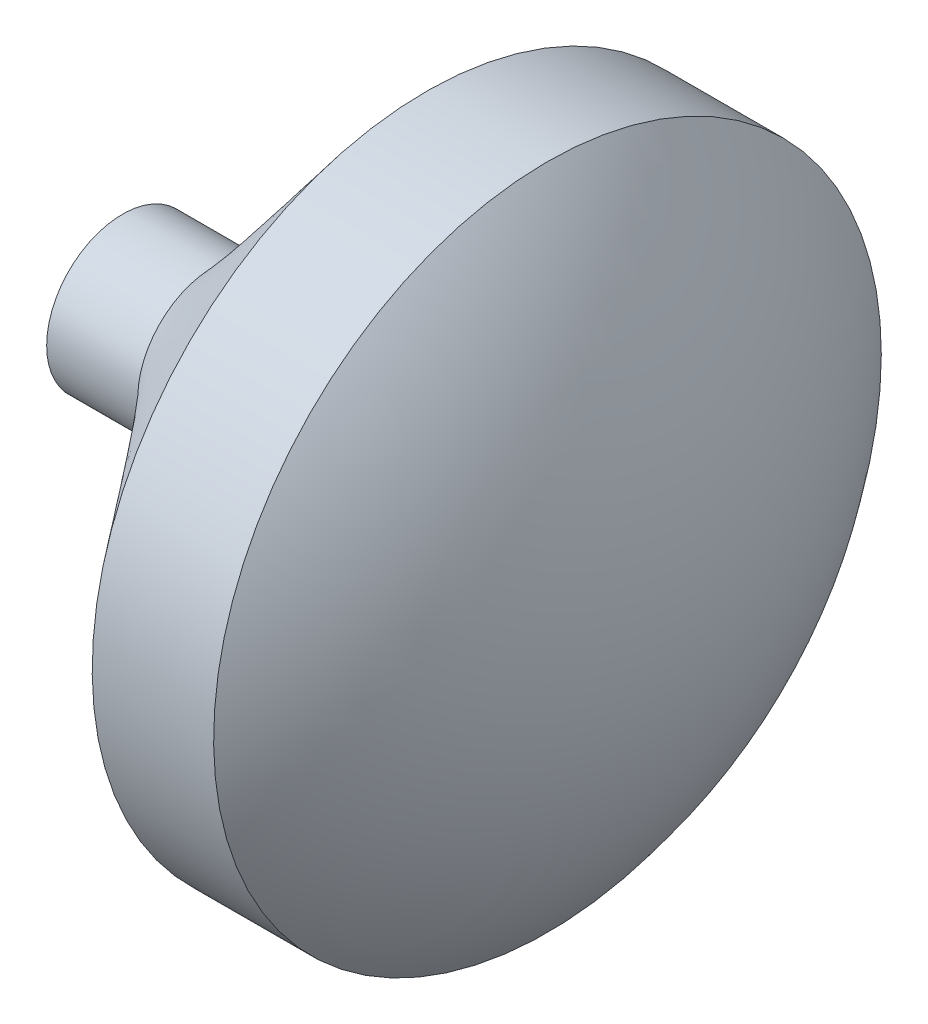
ISO-10303-21;
HEADER;
FILE_DESCRIPTION(('STEP AP214'),'2;1');
FILE_NAME('part.step','',(''),(''),'','','');
FILE_SCHEMA(('AUTOMOTIVE_DESIGN { 1 0 10303 214 1 1 1 1 }'));
ENDSEC;
DATA;
#1=APPLICATION_CONTEXT('core data for automotive mechanical design processes');
#2=APPLICATION_PROTOCOL_DEFINITION('international standard','automotive_design',2000,#1);
#3=PRODUCT_CONTEXT('',#1,'mechanical');
#4=PRODUCT('Part','Part','',(#3));
#5=PRODUCT_RELATED_PRODUCT_CATEGORY('part','',(#4));
#6=PRODUCT_DEFINITION_FORMATION('','',#4);
#7=PRODUCT_DEFINITION_CONTEXT('part definition',#1,'design');
#8=PRODUCT_DEFINITION('design','',#6,#7);
#9=PRODUCT_DEFINITION_SHAPE('','',#8);
#10=(LENGTH_UNIT() NAMED_UNIT(*) SI_UNIT(.MILLI.,.METRE.));
#11=(NAMED_UNIT(*) PLANE_ANGLE_UNIT() SI_UNIT($,.RADIAN.));
#12=(NAMED_UNIT(*) SI_UNIT($,.STERADIAN.) SOLID_ANGLE_UNIT());
#13=UNCERTAINTY_MEASURE_WITH_UNIT(LENGTH_MEASURE(1.E-05),#10,'distance_accuracy_value','');
#14=(GEOMETRIC_REPRESENTATION_CONTEXT(3) GLOBAL_UNCERTAINTY_ASSIGNED_CONTEXT((#13)) GLOBAL_UNIT_ASSIGNED_CONTEXT((#10,
#11,#12)) REPRESENTATION_CONTEXT('',''));
#15=CARTESIAN_POINT('',(0.,0.,0.));
#16=DIRECTION('',(0.,0.,1.));
#17=DIRECTION('',(1.,0.,0.));
#18=AXIS2_PLACEMENT_3D('',#15,#16,#17);
#19=CARTESIAN_POINT('',(10.16,0.,0.));
#20=DIRECTION('',(-1.,0.,0.));
#21=DIRECTION('',(0.,0.,1.));
#22=AXIS2_PLACEMENT_3D('',#19,#20,#21);
#23=CYLINDRICAL_SURFACE('',#22,27.94);
#24=CARTESIAN_POINT('',(10.16,0.,0.));
#25=DIRECTION('',(1.,0.,0.));
#26=DIRECTION('',(0.,0.,-1.));
#27=AXIS2_PLACEMENT_3D('',#24,#25,#26);
#28=CIRCLE('',#27,27.94);
#29=CARTESIAN_POINT('',(10.16,0.,-27.94));
#30=VERTEX_POINT('',#29);
#31=EDGE_CURVE('E11',#30,#30,#28,.T.);
#32=ORIENTED_EDGE('',*,*,#31,.F.);
#33=EDGE_LOOP('',(#32));
#34=FACE_BOUND('',#33,.T.);
#35=CARTESIAN_POINT('',(0.,0.,0.));
#36=DIRECTION('',(1.,0.,0.));
#37=DIRECTION('',(0.,0.,-1.));
#38=AXIS2_PLACEMENT_3D('',#35,#36,#37);
#39=CIRCLE('',#38,27.94);
#40=CARTESIAN_POINT('',(0.,2.13963996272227,27.857952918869));
#41=VERTEX_POINT('',#40);
#42=EDGE_CURVE('E40',#41,#41,#39,.T.);
#43=ORIENTED_EDGE('',*,*,#42,.T.);
#44=EDGE_LOOP('',(#43));
#45=FACE_BOUND('',#44,.T.);
#46=ADVANCED_FACE('F31',(#34,#45),#23,.T.);
#47=CARTESIAN_POINT('',(-23.1775,0.,0.));
#48=DIRECTION('',(0.,0.,1.));
#49=DIRECTION('',(1.,0.,0.));
#50=AXIS2_PLACEMENT_3D('',#47,#48,#49);
#51=SPHERICAL_SURFACE('',#50,43.4975);
#52=CARTESIAN_POINT('',(-23.1775,0.,0.));
#53=DIRECTION('',(1.,0.,0.));
#54=DIRECTION('',(0.,0.,-1.));
#55=AXIS2_PLACEMENT_3D('',#52,#53,#54);
#56=SPHERICAL_SURFACE('',#55,43.4975);
#57=ORIENTED_EDGE('',*,*,#31,.T.);
#58=EDGE_LOOP('',(#57));
#59=FACE_BOUND('',#58,.T.);
#60=ADVANCED_FACE('F33',(#59),#56,.T.);
#61=CARTESIAN_POINT('',(0.,2.13963996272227,27.857952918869));
#62=CARTESIAN_POINT('',(-17.78,-2.14723142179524,5.97594320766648));
#63=CARTESIAN_POINT('',(0.,57.8555458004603,23.5786729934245));
#64=CARTESIAN_POINT('',(-17.78,9.80465499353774,10.270406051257));
#65=CARTESIAN_POINT('',(0.,53.5762658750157,-32.1372328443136));
#66=CARTESIAN_POINT('',(-17.78,14.0991178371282,-1.68148036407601));
#67=CARTESIAN_POINT('',(0.,-2.13963996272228,-27.857952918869));
#68=CARTESIAN_POINT('',(-17.78,2.14723142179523,-5.97594320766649));
#69=CARTESIAN_POINT('',(0.,-57.8555458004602,-23.5786729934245));
#70=CARTESIAN_POINT('',(-17.78,-9.80465499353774,-10.270406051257));
#71=CARTESIAN_POINT('',(0.,-53.5762658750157,32.1372328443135));
#72=CARTESIAN_POINT('',(-17.78,-14.0991178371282,1.68148036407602));
#73=CARTESIAN_POINT('',(0.,2.13963996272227,27.857952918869));
#74=CARTESIAN_POINT('',(-17.78,-2.14723142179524,5.97594320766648));
#75=(BOUNDED_SURFACE() B_SPLINE_SURFACE(3,1,((#61,#62),(#63,#64),(#65,#66),(#67,#68),(#69,#70),
(#71,#72),(#73,#74)),.UNSPECIFIED.,.T.,.F.,.F.) B_SPLINE_SURFACE_WITH_KNOTS((4,3,4),(2,2),(0.,
0.5,1.),(0.,1.),.UNSPECIFIED.) GEOMETRIC_REPRESENTATION_ITEM() RATIONAL_B_SPLINE_SURFACE(((1.,
1.),(0.333333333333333,0.333333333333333),(0.333333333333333,0.333333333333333),(1.,1.),
(0.333333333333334,0.333333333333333),(0.333333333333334,0.333333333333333),(1.,1.))) REPRESENTATION_ITEM('') SURFACE());
#76=CARTESIAN_POINT('',(-17.78,0.,0.));
#77=DIRECTION('',(-1.,0.,0.));
#78=DIRECTION('',(0.,0.,1.));
#79=AXIS2_PLACEMENT_3D('',#76,#77,#78);
#80=CIRCLE('',#79,6.35);
#81=CARTESIAN_POINT('',(-17.78,-2.14723142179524,5.97594320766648));
#82=VERTEX_POINT('',#81);
#83=EDGE_CURVE('E35',#82,#82,#80,.T.);
#84=CARTESIAN_POINT('',(0.,2.13963996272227,27.857952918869));
#85=CARTESIAN_POINT('',(-0.185208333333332,2.09498505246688,27.6300153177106));
#86=CARTESIAN_POINT('',(-0.370416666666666,2.05033014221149,27.4020777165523));
#87=CARTESIAN_POINT('',(-0.740833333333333,1.96102032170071,26.9462025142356));
#88=CARTESIAN_POINT('',(-0.926041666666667,1.91636541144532,26.7182649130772));
#89=CARTESIAN_POINT('',(-1.29645833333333,1.82705559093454,26.2623897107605));
#90=CARTESIAN_POINT('',(-1.48166666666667,1.78240068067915,26.0344521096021));
#91=CARTESIAN_POINT('',(-1.85208333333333,1.69309086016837,25.5785769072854));
#92=CARTESIAN_POINT('',(-2.03729166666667,1.64843594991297,25.3506393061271));
#93=CARTESIAN_POINT('',(-2.40770833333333,1.55912612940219,24.8947641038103));
#94=CARTESIAN_POINT('',(-2.59291666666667,1.5144712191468,24.666826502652));
#95=CARTESIAN_POINT('',(-2.96333333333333,1.42516139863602,24.2109513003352));
#96=CARTESIAN_POINT('',(-3.14854166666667,1.38050648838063,23.9830136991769));
#97=CARTESIAN_POINT('',(-3.51895833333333,1.29119666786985,23.5271384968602));
#98=CARTESIAN_POINT('',(-3.70416666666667,1.24654175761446,23.2992008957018));
#99=CARTESIAN_POINT('',(-4.07458333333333,1.15723193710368,22.8433256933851));
#100=CARTESIAN_POINT('',(-4.25979166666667,1.11257702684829,22.6153880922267));
#101=CARTESIAN_POINT('',(-4.63020833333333,1.0232672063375,22.15951288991));
#102=CARTESIAN_POINT('',(-4.81541666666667,0.978612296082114,21.9315752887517));
#103=CARTESIAN_POINT('',(-5.18583333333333,0.889302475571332,21.4757000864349));
#104=CARTESIAN_POINT('',(-5.37104166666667,0.844647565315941,21.2477624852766));
#105=CARTESIAN_POINT('',(-5.74145833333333,0.755337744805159,20.7918872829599));
#106=CARTESIAN_POINT('',(-5.92666666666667,0.710682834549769,20.5639496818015));
#107=CARTESIAN_POINT('',(-6.29708333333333,0.621373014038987,20.1080744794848));
#108=CARTESIAN_POINT('',(-6.48229166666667,0.576718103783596,19.8801368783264));
#109=CARTESIAN_POINT('',(-6.85270833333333,0.487408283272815,19.4242616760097));
#110=CARTESIAN_POINT('',(-7.03791666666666,0.442753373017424,19.1963240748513));
#111=CARTESIAN_POINT('',(-7.40833333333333,0.353443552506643,18.7404488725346));
#112=CARTESIAN_POINT('',(-7.59354166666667,0.308788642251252,18.5125112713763));
#113=CARTESIAN_POINT('',(-7.96395833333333,0.21947882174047,18.0566360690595));
#114=CARTESIAN_POINT('',(-8.14916666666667,0.174823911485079,17.8286984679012));
#115=CARTESIAN_POINT('',(-8.51958333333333,0.085514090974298,17.3728232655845));
#116=CARTESIAN_POINT('',(-8.70479166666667,0.0408591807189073,17.1448856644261));
#117=CARTESIAN_POINT('',(-9.07520833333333,-0.0484506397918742,16.6890104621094));
#118=CARTESIAN_POINT('',(-9.26041666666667,-0.093105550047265,16.461072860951));
#119=CARTESIAN_POINT('',(-9.63083333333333,-0.182415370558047,16.0051976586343));
#120=CARTESIAN_POINT('',(-9.81604166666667,-0.227070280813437,15.7772600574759));
#121=CARTESIAN_POINT('',(-10.1864583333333,-0.316380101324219,15.3213848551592));
#122=CARTESIAN_POINT('',(-10.3716666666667,-0.36103501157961,15.0934472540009));
#123=CARTESIAN_POINT('',(-10.7420833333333,-0.450344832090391,14.6375720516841));
#124=CARTESIAN_POINT('',(-10.9272916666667,-0.494999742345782,14.4096344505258));
#125=CARTESIAN_POINT('',(-11.2977083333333,-0.584309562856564,13.9537592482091));
#126=CARTESIAN_POINT('',(-11.4829166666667,-0.628964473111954,13.7258216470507));
#127=CARTESIAN_POINT('',(-11.8533333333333,-0.718274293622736,13.269946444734));
#128=CARTESIAN_POINT('',(-12.0385416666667,-0.762929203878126,13.0420088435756));
#129=CARTESIAN_POINT('',(-12.4089583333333,-0.852239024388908,12.5861336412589));
#130=CARTESIAN_POINT('',(-12.5941666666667,-0.896893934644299,12.3581960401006));
#131=CARTESIAN_POINT('',(-12.9645833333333,-0.986203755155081,11.9023208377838));
#132=CARTESIAN_POINT('',(-13.1497916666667,-1.03085866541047,11.6743832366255));
#133=CARTESIAN_POINT('',(-13.5202083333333,-1.12016848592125,11.2185080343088));
#134=CARTESIAN_POINT('',(-13.7054166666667,-1.16482339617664,10.9905704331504));
#135=CARTESIAN_POINT('',(-14.0758333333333,-1.25413321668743,10.5346952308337));
#136=CARTESIAN_POINT('',(-14.2610416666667,-1.29878812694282,10.3067576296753));
#137=CARTESIAN_POINT('',(-14.6314583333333,-1.3880979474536,9.8508824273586));
#138=CARTESIAN_POINT('',(-14.8166666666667,-1.43275285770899,9.62294482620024));
#139=CARTESIAN_POINT('',(-15.1870833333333,-1.52206267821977,9.16706962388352));
#140=CARTESIAN_POINT('',(-15.3722916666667,-1.56671758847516,8.93913202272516));
#141=CARTESIAN_POINT('',(-15.7427083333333,-1.65602740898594,8.48325682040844));
#142=CARTESIAN_POINT('',(-15.9279166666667,-1.70068231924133,8.25531921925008));
#143=CARTESIAN_POINT('',(-16.2983333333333,-1.78999213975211,7.79944401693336));
#144=CARTESIAN_POINT('',(-16.4835416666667,-1.83464705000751,7.571506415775));
#145=CARTESIAN_POINT('',(-16.8539583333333,-1.92395687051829,7.11563121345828));
#146=CARTESIAN_POINT('',(-17.0391666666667,-1.96861178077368,6.88769361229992));
#147=CARTESIAN_POINT('',(-17.4095833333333,-2.05792160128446,6.4318184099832));
#148=CARTESIAN_POINT('',(-17.5947916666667,-2.10257651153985,6.20388080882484));
#149=CARTESIAN_POINT('',(-17.78,-2.14723142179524,5.97594320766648));
#150=B_SPLINE_CURVE_WITH_KNOTS('',3,(#84,#85,#86,#87,#88,#89,#90,#91,#92,#93,#94,#95,#96,#97,
#98,#99,#100,#101,#102,#103,#104,#105,#106,#107,#108,#109,#110,#111,#112,#113,#114,#115,#116,
#117,#118,#119,#120,#121,#122,#123,#124,#125,#126,#127,#128,#129,#130,#131,#132,#133,#134,#135,
#136,#137,#138,#139,#140,#141,#142,#143,#144,#145,#146,#147,#148,#149),.UNSPECIFIED.,.F.,.F.,(4,
2,2,2,2,2,2,2,2,2,2,2,2,2,2,2,2,2,2,2,2,2,2,2,2,2,2,2,2,2,2,2,4),(0.,0.891215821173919,
1.78243164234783,2.67364746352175,3.56486328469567,4.45607910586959,5.3472949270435,
6.23851074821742,7.12972656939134,8.02094239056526,8.91215821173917,9.80337403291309,
10.694589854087,11.5858056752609,12.4770214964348,13.3682373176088,14.2594531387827,
15.1506689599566,16.0418847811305,16.9331006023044,17.8243164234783,18.7155322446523,
19.6067480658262,20.4979638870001,21.389179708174,22.2803955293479,23.1716113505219,
24.0628271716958,24.9540429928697,25.8452588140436,26.7364746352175,27.6276904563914,
28.5189062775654),.UNSPECIFIED.);
#151=EDGE_CURVE('BSEAM65',#41,#82,#150,.T.);
#152=ORIENTED_EDGE('',*,*,#42,.F.);
#153=ORIENTED_EDGE('',*,*,#83,.F.);
#154=ORIENTED_EDGE('',*,*,#151,.T.);
#155=ORIENTED_EDGE('',*,*,#151,.F.);
#156=EDGE_LOOP('',(#152,#154,#153,#155));
#157=FACE_BOUND('',#156,.T.);
#158=ADVANCED_FACE('F65',(#157),#75,.T.);
#159=CARTESIAN_POINT('',(-25.4,0.,0.));
#160=DIRECTION('',(1.,0.,0.));
#161=DIRECTION('',(0.,0.,-1.));
#162=AXIS2_PLACEMENT_3D('',#159,#160,#161);
#163=CYLINDRICAL_SURFACE('',#162,6.35);
#164=CARTESIAN_POINT('',(-25.4,0.,0.));
#165=DIRECTION('',(-1.,0.,0.));
#166=DIRECTION('',(0.,0.,1.));
#167=AXIS2_PLACEMENT_3D('',#164,#165,#166);
#168=CIRCLE('',#167,6.35);
#169=CARTESIAN_POINT('',(-25.4,0.,6.35));
#170=VERTEX_POINT('',#169);
#171=EDGE_CURVE('E88',#170,#170,#168,.T.);
#172=ORIENTED_EDGE('',*,*,#171,.F.);
#173=EDGE_LOOP('',(#172));
#174=FACE_BOUND('',#173,.T.);
#175=ORIENTED_EDGE('',*,*,#83,.T.);
#176=EDGE_LOOP('',(#175));
#177=FACE_BOUND('',#176,.T.);
#178=ADVANCED_FACE('F54',(#174,#177),#163,.T.);
#179=CARTESIAN_POINT('',(-25.4,0.,0.));
#180=DIRECTION('',(-1.,0.,0.));
#181=DIRECTION('',(0.,0.,1.));
#182=AXIS2_PLACEMENT_3D('',#179,#180,#181);
#183=PLANE('',#182);
#184=ORIENTED_EDGE('',*,*,#171,.T.);
#185=EDGE_LOOP('',(#184));
#186=FACE_BOUND('',#185,.T.);
#187=ADVANCED_FACE('F64',(#186),#183,.T.);
#188=CLOSED_SHELL('',(#46,#60,#158,#178,#187));
#189=MANIFOLD_SOLID_BREP('B2',#188);
#190=ADVANCED_BREP_SHAPE_REPRESENTATION('',(#18,#189),#14);
#191=SHAPE_DEFINITION_REPRESENTATION(#9,#190);
ENDSEC;
END-ISO-10303-21;
